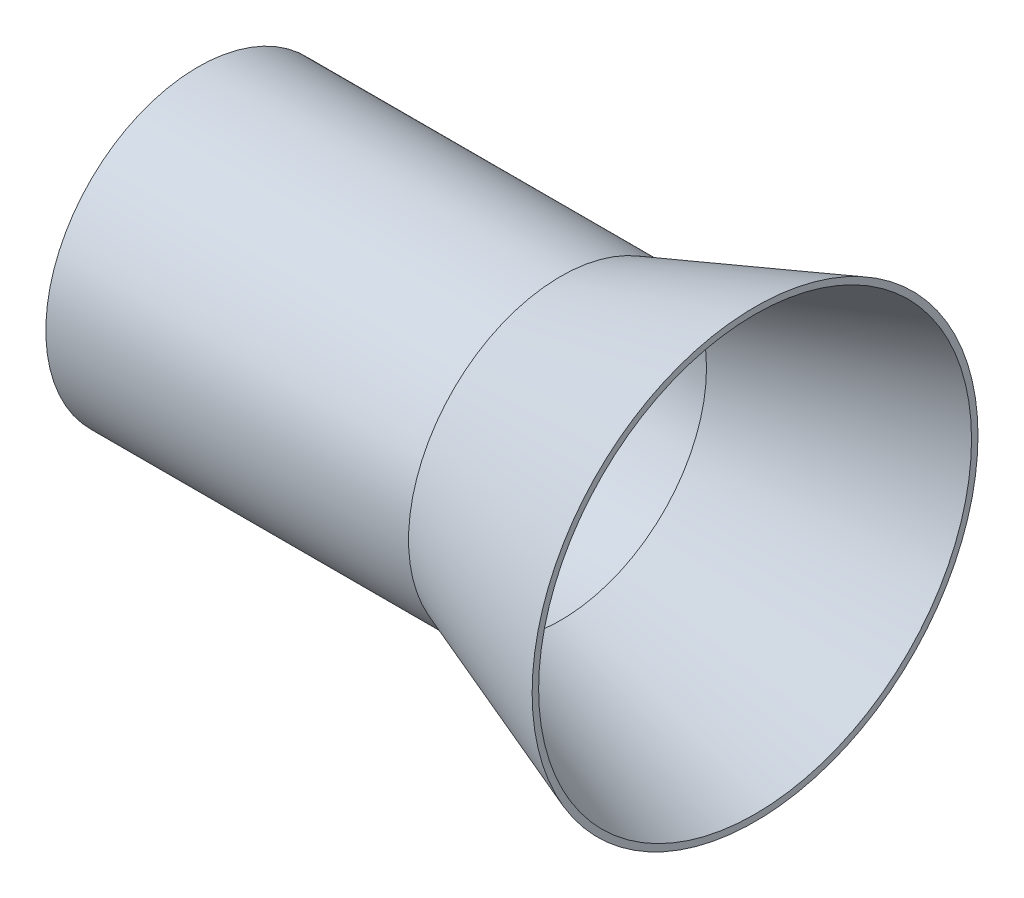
from build123d import *

# Parameters (mm, degrees)
SKETCH_1_R      = 47
SKETCH_1_R_2    = 45
EXTRUDE_1_DEPTH = 112


with BuildPart() as part:
    # Sketch 1 → Extrude 1 (new body)
    with BuildSketch(Plane(origin=(0, 0, 0), x_dir=(0, 0, -1), z_dir=(1, 0, 0))):
        Circle(SKETCH_1_R)
        Circle(SKETCH_1_R_2, mode=Mode.SUBTRACT)
    extrude(amount=EXTRUDE_1_DEPTH)

    # Sketch 2 → Revolve 1 (revolve)
    with BuildSketch(Plane(origin=(0, 0, 0), x_dir=(1, 0, 0), z_dir=(0, 1, 0))):
        Polygon((112, -45), (172, -66.838214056), (172, -68.838214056), (112, -47), align=None)
    revolve(axis=Axis((112, 0, 0), (1, 0, 0)))


solid = part.part
